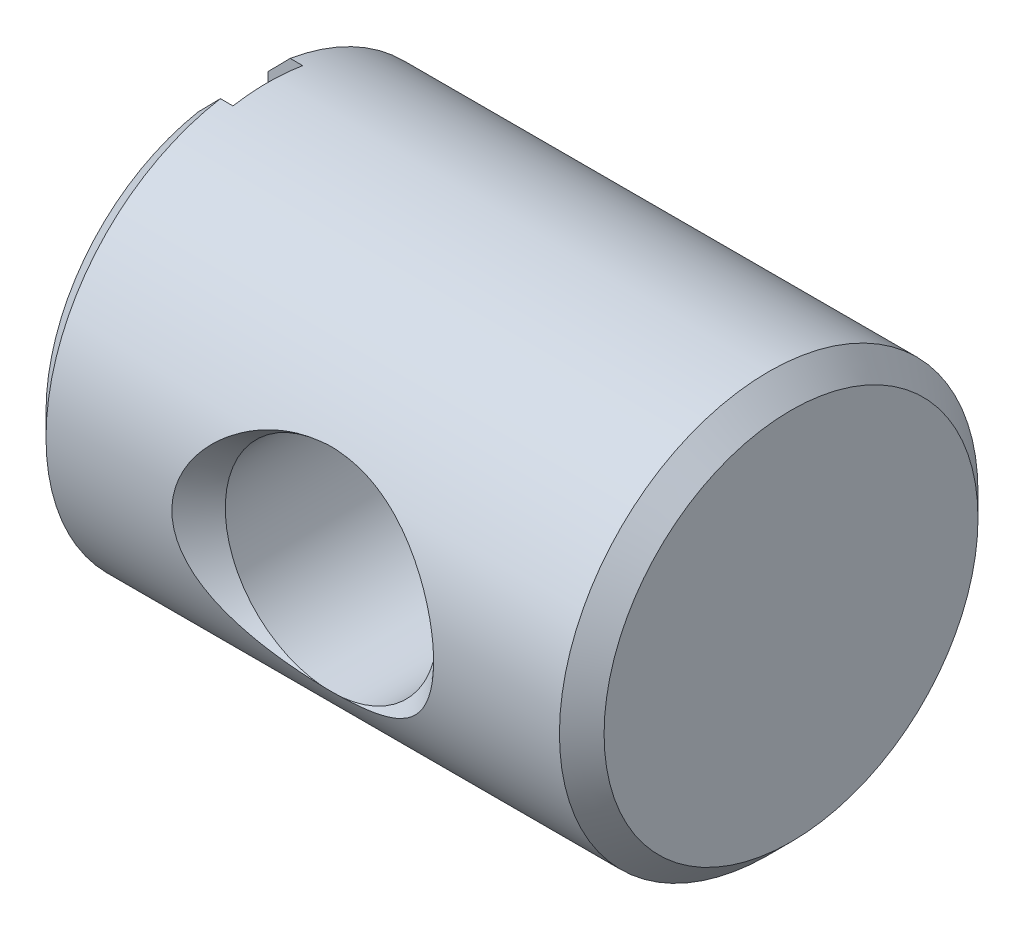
ISO-10303-21;
HEADER;
FILE_DESCRIPTION(('STEP AP214'),'2;1');
FILE_NAME('part.step','',(''),(''),'','','');
FILE_SCHEMA(('AUTOMOTIVE_DESIGN { 1 0 10303 214 1 1 1 1 }'));
ENDSEC;
DATA;
#1=APPLICATION_CONTEXT('core data for automotive mechanical design processes');
#2=APPLICATION_PROTOCOL_DEFINITION('international standard','automotive_design',2000,#1);
#3=PRODUCT_CONTEXT('',#1,'mechanical');
#4=PRODUCT('Part','Part','',(#3));
#5=PRODUCT_RELATED_PRODUCT_CATEGORY('part','',(#4));
#6=PRODUCT_DEFINITION_FORMATION('','',#4);
#7=PRODUCT_DEFINITION_CONTEXT('part definition',#1,'design');
#8=PRODUCT_DEFINITION('design','',#6,#7);
#9=PRODUCT_DEFINITION_SHAPE('','',#8);
#10=(LENGTH_UNIT() NAMED_UNIT(*) SI_UNIT(.MILLI.,.METRE.));
#11=(NAMED_UNIT(*) PLANE_ANGLE_UNIT() SI_UNIT($,.RADIAN.));
#12=(NAMED_UNIT(*) SI_UNIT($,.STERADIAN.) SOLID_ANGLE_UNIT());
#13=UNCERTAINTY_MEASURE_WITH_UNIT(LENGTH_MEASURE(1.E-05),#10,'distance_accuracy_value','');
#14=(GEOMETRIC_REPRESENTATION_CONTEXT(3) GLOBAL_UNCERTAINTY_ASSIGNED_CONTEXT((#13)) GLOBAL_UNIT_ASSIGNED_CONTEXT((#10,
#11,#12)) REPRESENTATION_CONTEXT('',''));
#15=CARTESIAN_POINT('',(0.,0.,0.));
#16=DIRECTION('',(0.,0.,1.));
#17=DIRECTION('',(1.,0.,0.));
#18=AXIS2_PLACEMENT_3D('',#15,#16,#17);
#19=CARTESIAN_POINT('',(0.,0.,-6.66133814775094E-13));
#20=DIRECTION('',(1.,0.,0.));
#21=DIRECTION('',(0.,0.,-0.999999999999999));
#22=AXIS2_PLACEMENT_3D('',#19,#20,#21);
#23=PLANE('',#22);
#24=CARTESIAN_POINT('',(0.,0.,-6.66133814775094E-13));
#25=DIRECTION('',(1.,0.,0.));
#26=DIRECTION('',(0.,0.,-0.999999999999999));
#27=AXIS2_PLACEMENT_3D('',#24,#25,#26);
#28=CIRCLE('',#27,4.2545);
#29=CARTESIAN_POINT('',(0.,4.17980037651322,-0.793750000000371));
#30=VERTEX_POINT('',#29);
#31=CARTESIAN_POINT('',(0.,-4.17980037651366,-0.793750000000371));
#32=VERTEX_POINT('',#31);
#33=EDGE_CURVE('E124',#30,#32,#28,.F.);
#34=ORIENTED_EDGE('',*,*,#33,.T.);
#35=DIRECTION('',(0.,-1.,0.));
#36=VECTOR('',#35,1.);
#37=CARTESIAN_POINT('',(0.,5.00902571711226,-0.793750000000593));
#38=LINE('',#37,#36);
#39=EDGE_CURVE('E112',#30,#32,#38,.T.);
#40=ORIENTED_EDGE('',*,*,#39,.F.);
#41=EDGE_LOOP('',(#34,#40));
#42=FACE_BOUND('',#41,.T.);
#43=ADVANCED_FACE('F34',(#42),#23,.F.);
#44=CARTESIAN_POINT('',(0.507999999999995,0.,-6.66133814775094E-13));
#45=DIRECTION('',(1.,0.,0.));
#46=DIRECTION('',(0.,0.,-0.999999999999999));
#47=AXIS2_PLACEMENT_3D('',#44,#45,#46);
#48=CONICAL_SURFACE('',#47,4.7625,0.785398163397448);
#49=CARTESIAN_POINT('',(6.23132222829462,10.4557366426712,-0.793750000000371));
#50=CARTESIAN_POINT('',(5.86203882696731,10.0853813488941,-0.793750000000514));
#51=CARTESIAN_POINT('',(5.49280300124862,9.71497856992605,-0.793750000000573));
#52=CARTESIAN_POINT('',(4.75447807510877,8.97400009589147,-0.793750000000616));
#53=CARTESIAN_POINT('',(4.38538898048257,8.60342439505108,-0.7937500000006));
#54=CARTESIAN_POINT('',(3.64711099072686,7.86172258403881,-0.793750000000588));
#55=CARTESIAN_POINT('',(3.27792229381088,7.49059627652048,-0.793750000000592));
#56=CARTESIAN_POINT('',(2.53990734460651,6.74800938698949,-0.793750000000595));
#57=CARTESIAN_POINT('',(2.1710810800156,6.37654881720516,-0.793750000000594));
#58=CARTESIAN_POINT('',(1.45003315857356,5.64923662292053,-0.793750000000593));
#59=CARTESIAN_POINT('',(1.0977872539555,5.29340905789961,-0.793750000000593));
#60=CARTESIAN_POINT('',(0.570108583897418,4.75894843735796,-0.793750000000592));
#61=CARTESIAN_POINT('',(0.394321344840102,4.58066546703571,-0.793750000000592));
#62=CARTESIAN_POINT('',(0.0430866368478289,4.22376861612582,-0.793750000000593));
#63=CARTESIAN_POINT('',(-0.132360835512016,4.04515473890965,-0.793750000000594));
#64=CARTESIAN_POINT('',(-0.482670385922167,3.68754122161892,-0.79375000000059));
#65=CARTESIAN_POINT('',(-0.657532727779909,3.50854184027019,-0.793750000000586));
#66=CARTESIAN_POINT('',(-1.00650015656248,3.1497926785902,-0.793750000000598));
#67=CARTESIAN_POINT('',(-1.18060521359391,2.9700428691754,-0.793750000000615));
#68=CARTESIAN_POINT('',(-1.52753340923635,2.60936896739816,-0.793750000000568));
#69=CARTESIAN_POINT('',(-1.70035678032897,2.42844509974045,-0.793750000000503));
#70=CARTESIAN_POINT('',(-1.95780301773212,2.15538188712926,-0.793750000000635));
#71=CARTESIAN_POINT('',(-2.04331765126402,2.0640841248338,-0.793750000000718));
#72=CARTESIAN_POINT('',(-2.21347142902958,1.88067714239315,-0.793750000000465));
#73=CARTESIAN_POINT('',(-2.29811059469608,1.78856794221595,-0.793750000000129));
#74=CARTESIAN_POINT('',(-2.40539639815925,1.67010823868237,-0.793750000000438));
#75=CARTESIAN_POINT('',(-2.42866080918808,1.64431710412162,-0.793750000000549));
#76=CARTESIAN_POINT('',(-2.47507003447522,1.59262735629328,-0.793750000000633));
#77=CARTESIAN_POINT('',(-2.4982148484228,1.56672874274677,-0.793750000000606));
#78=CARTESIAN_POINT('',(-2.56745025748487,1.48884681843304,-0.793750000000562));
#79=CARTESIAN_POINT('',(-2.61333750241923,1.43668217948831,-0.793750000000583));
#80=CARTESIAN_POINT('',(-2.70471133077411,1.3313519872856,-0.793750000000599));
#81=CARTESIAN_POINT('',(-2.75019276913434,1.27818196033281,-0.793750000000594));
#82=CARTESIAN_POINT('',(-2.84013234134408,1.17100297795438,-0.793750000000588));
#83=CARTESIAN_POINT('',(-2.88459073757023,1.11699424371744,-0.793750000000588));
#84=CARTESIAN_POINT('',(-2.97241558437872,1.00736786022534,-0.793750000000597));
#85=CARTESIAN_POINT('',(-3.01577022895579,0.951740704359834,-0.793750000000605));
#86=CARTESIAN_POINT('',(-3.10026069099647,0.838830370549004,-0.793750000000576));
#87=CARTESIAN_POINT('',(-3.14139721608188,0.781547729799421,-0.793750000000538));
#88=CARTESIAN_POINT('',(-3.21994094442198,0.664929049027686,-0.793750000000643));
#89=CARTESIAN_POINT('',(-3.25736795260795,0.605606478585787,-0.793750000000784));
#90=CARTESIAN_POINT('',(-3.32635890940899,0.483668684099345,-0.793750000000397));
#91=CARTESIAN_POINT('',(-3.35793849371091,0.421062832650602,-0.793749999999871));
#92=CARTESIAN_POINT('',(-3.39437091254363,0.33206158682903,-0.793750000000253));
#93=CARTESIAN_POINT('',(-3.40359743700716,0.307472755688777,-0.79375000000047));
#94=CARTESIAN_POINT('',(-3.42029474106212,0.257710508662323,-0.793750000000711));
#95=CARTESIAN_POINT('',(-3.42776544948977,0.232537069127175,-0.793750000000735));
#96=CARTESIAN_POINT('',(-3.44695718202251,0.156398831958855,-0.793750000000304));
#97=CARTESIAN_POINT('',(-3.45557091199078,0.104557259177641,-0.793749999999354));
#98=CARTESIAN_POINT('',(-3.46076387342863,0.0260808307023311,-0.793749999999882));
#99=CARTESIAN_POINT('',(-3.46118841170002,-0.000337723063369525,-0.793750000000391));
#100=CARTESIAN_POINT('',(-3.459412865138,-0.0530874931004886,-0.79375000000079));
#101=CARTESIAN_POINT('',(-3.45721274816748,-0.0794187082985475,-0.79375000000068));
#102=CARTESIAN_POINT('',(-3.44683249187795,-0.158045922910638,-0.793750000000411));
#103=CARTESIAN_POINT('',(-3.43486573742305,-0.209860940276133,-0.793750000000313));
#104=CARTESIAN_POINT('',(-3.40723922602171,-0.298575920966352,-0.793750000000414));
#105=CARTESIAN_POINT('',(-3.39319917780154,-0.336023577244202,-0.793750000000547));
#106=CARTESIAN_POINT('',(-3.36192361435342,-0.409582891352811,-0.793750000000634));
#107=CARTESIAN_POINT('',(-3.34468563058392,-0.445693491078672,-0.793750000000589));
#108=CARTESIAN_POINT('',(-3.30779970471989,-0.516850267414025,-0.793750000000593));
#109=CARTESIAN_POINT('',(-3.28814100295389,-0.55189075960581,-0.793750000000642));
#110=CARTESIAN_POINT('',(-3.24711633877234,-0.620927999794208,-0.793750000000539));
#111=CARTESIAN_POINT('',(-3.22575109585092,-0.654925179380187,-0.793750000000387));
#112=CARTESIAN_POINT('',(-3.17751309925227,-0.728545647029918,-0.793750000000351));
#113=CARTESIAN_POINT('',(-3.15037194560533,-0.767991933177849,-0.793750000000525));
#114=CARTESIAN_POINT('',(-3.09478419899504,-0.845957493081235,-0.793750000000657));
#115=CARTESIAN_POINT('',(-3.06633735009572,-0.884476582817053,-0.793750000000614));
#116=CARTESIAN_POINT('',(-2.97953286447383,-0.999003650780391,-0.793750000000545));
#117=CARTESIAN_POINT('',(-2.91974864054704,-1.07392668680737,-0.793750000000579));
#118=CARTESIAN_POINT('',(-2.7978368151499,-1.22212182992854,-0.793750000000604));
#119=CARTESIAN_POINT('',(-2.7357038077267,-1.29538941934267,-0.793750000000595));
#120=CARTESIAN_POINT('',(-2.61004586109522,-1.44066547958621,-0.793750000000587));
#121=CARTESIAN_POINT('',(-2.54652150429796,-1.51267445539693,-0.793750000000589));
#122=CARTESIAN_POINT('',(-2.41839516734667,-1.65597989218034,-0.793750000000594));
#123=CARTESIAN_POINT('',(-2.35379130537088,-1.72727466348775,-0.793750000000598));
#124=CARTESIAN_POINT('',(-2.22390237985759,-1.86925325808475,-0.793750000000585));
#125=CARTESIAN_POINT('',(-2.15861724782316,-1.9399370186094,-0.793750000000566));
#126=CARTESIAN_POINT('',(-2.02765571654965,-2.08073615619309,-0.793750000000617));
#127=CARTESIAN_POINT('',(-1.96198008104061,-2.15085224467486,-0.793750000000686));
#128=CARTESIAN_POINT('',(-1.83025975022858,-2.29073195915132,-0.793750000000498));
#129=CARTESIAN_POINT('',(-1.76421506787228,-2.36049559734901,-0.793750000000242));
#130=CARTESIAN_POINT('',(-1.56688955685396,-2.56808538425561,-0.793749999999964));
#131=CARTESIAN_POINT('',(-1.43519459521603,-2.70551770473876,-0.79375000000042));
#132=CARTESIAN_POINT('',(-1.17110124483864,-2.97970525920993,-0.793750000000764));
#133=CARTESIAN_POINT('',(-1.03870285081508,-3.11646048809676,-0.793750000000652));
#134=CARTESIAN_POINT('',(-0.640799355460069,-3.52605432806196,-0.793750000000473));
#135=CARTESIAN_POINT('',(-0.374594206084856,-3.79821246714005,-0.793750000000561));
#136=CARTESIAN_POINT('',(0.158928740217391,-4.34176550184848,-0.793750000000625));
#137=CARTESIAN_POINT('',(0.426247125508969,-4.61315981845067,-0.7937500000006));
#138=CARTESIAN_POINT('',(0.961448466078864,-5.15538292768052,-0.793750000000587));
#139=CARTESIAN_POINT('',(1.22933141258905,-5.42621172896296,-0.793750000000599));
#140=CARTESIAN_POINT('',(1.7648115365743,-5.96686254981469,-0.79375000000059));
#141=CARTESIAN_POINT('',(2.03240785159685,-6.23668542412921,-0.79375000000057));
#142=CARTESIAN_POINT('',(2.56784471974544,-6.77609086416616,-0.79375000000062));
#143=CARTESIAN_POINT('',(2.83568527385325,-7.0456734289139,-0.793750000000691));
#144=CARTESIAN_POINT('',(3.63937411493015,-7.85408378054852,-0.793750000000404));
#145=CARTESIAN_POINT('',(4.17547502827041,-8.39266038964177,-0.793749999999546));
#146=CARTESIAN_POINT('',(4.83830179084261,-9.05809706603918,-0.793750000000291));
#147=CARTESIAN_POINT('',(4.96485547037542,-9.18512874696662,-0.793750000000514));
#148=CARTESIAN_POINT('',(5.21798499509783,-9.43917644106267,-0.793750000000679));
#149=CARTESIAN_POINT('',(5.34456084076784,-9.5661924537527,-0.79375000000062));
#150=CARTESIAN_POINT('',(5.5978273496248,-9.82030661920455,-0.793750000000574));
#151=CARTESIAN_POINT('',(5.72451802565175,-9.9474047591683,-0.793750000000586));
#152=CARTESIAN_POINT('',(5.97791101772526,-10.2015830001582,-0.793750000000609));
#153=CARTESIAN_POINT('',(6.10461333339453,-10.3286631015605,-0.793750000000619));
#154=CARTESIAN_POINT('',(6.23132222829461,-10.4557366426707,-0.793750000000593));
#155=B_SPLINE_CURVE_WITH_KNOTS('',3,(#49,#50,#51,#52,#53,#54,#55,#56,#57,#58,#59,#60,#61,#62,
#63,#64,#65,#66,#67,#68,#69,#70,#71,#72,#73,#74,#75,#76,#77,#78,#79,#80,#81,#82,#83,#84,#85,#86,
#87,#88,#89,#90,#91,#92,#93,#94,#95,#96,#97,#98,#99,#100,#101,#102,#103,#104,#105,#106,#107,
#108,#109,#110,#111,#112,#113,#114,#115,#116,#117,#118,#119,#120,#121,#122,#123,#124,#125,#126,
#127,#128,#129,#130,#131,#132,#133,#134,#135,#136,#137,#138,#139,#140,#141,#142,#143,#144,#145,
#146,#147,#148,#149,#150,#151,#152,#153,#154),.UNSPECIFIED.,.F.,.F.,(4,2,2,2,2,2,2,2,2,2,2,2,2,
2,2,2,2,2,2,2,2,2,2,2,2,2,2,2,2,2,2,2,2,2,2,2,2,2,2,2,2,2,2,2,2,2,2,2,2,2,2,2,4),(0.,
1.56901230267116,3.13808140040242,4.70853189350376,6.27892709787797,7.78099579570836,
8.53211046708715,9.28321752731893,10.03392115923,10.7846541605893,11.5352474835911,
11.9105207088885,12.2857847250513,12.389984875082,12.4941852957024,12.7026054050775,
12.9125027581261,13.1223456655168,13.333893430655,13.5453733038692,13.7556552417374,
13.9653665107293,14.0440946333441,14.1228259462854,14.2794494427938,14.3585974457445,
14.4377464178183,14.5963825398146,14.7162089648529,14.836128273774,14.9566012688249,
15.0770237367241,15.2206310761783,15.3642666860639,15.6517364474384,15.9399138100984,
16.2279727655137,16.5166010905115,16.8052587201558,17.0934687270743,17.3816686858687,
17.9526989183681,18.5237334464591,19.6658383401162,20.8086525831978,21.951449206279,
23.0914970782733,24.2315495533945,26.5112904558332,27.0492271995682,27.5871775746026,
28.1255456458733,28.6639000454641),.UNSPECIFIED.);
#156=CARTESIAN_POINT('',(0.507999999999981,4.69588832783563,-0.793750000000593));
#157=VERTEX_POINT('',#156);
#158=EDGE_CURVE('E109',#157,#30,#155,.T.);
#159=ORIENTED_EDGE('',*,*,#158,.F.);
#160=CARTESIAN_POINT('',(0.507999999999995,0.,-6.66133814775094E-13));
#161=DIRECTION('',(1.,0.,0.));
#162=DIRECTION('',(0.,0.,-0.999999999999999));
#163=AXIS2_PLACEMENT_3D('',#160,#161,#162);
#164=CIRCLE('',#163,4.7625);
#165=CARTESIAN_POINT('',(0.507999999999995,-4.69588832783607,-0.793750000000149));
#166=VERTEX_POINT('',#165);
#167=EDGE_CURVE('E133',#166,#157,#164,.T.);
#168=ORIENTED_EDGE('',*,*,#167,.F.);
#169=EDGE_CURVE('E121',#32,#166,#155,.T.);
#170=ORIENTED_EDGE('',*,*,#169,.F.);
#171=ORIENTED_EDGE('',*,*,#33,.F.);
#172=EDGE_LOOP('',(#159,#168,#170,#171));
#173=FACE_BOUND('',#172,.T.);
#174=ADVANCED_FACE('F126',(#173),#48,.T.);
#175=CARTESIAN_POINT('',(6.34999999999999,-8.88178419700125E-13,-1.33613340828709));
#176=DIRECTION('',(0.,0.,-0.999999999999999));
#177=DIRECTION('',(0.,1.,0.));
#178=AXIS2_PLACEMENT_3D('',#175,#176,#177);
#179=CONICAL_SURFACE('',#178,0.,0.715584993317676);
#180=CARTESIAN_POINT('',(3.80807046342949,-1.25103311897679,-4.5952519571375));
#181=CARTESIAN_POINT('',(3.89345549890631,-1.36398602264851,-4.56450178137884));
#182=CARTESIAN_POINT('',(3.98856847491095,-1.46898019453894,-4.53144182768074));
#183=CARTESIAN_POINT('',(4.19393498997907,-1.66250313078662,-4.4640813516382));
#184=CARTESIAN_POINT('',(4.30421233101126,-1.75100548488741,-4.42977894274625));
#185=CARTESIAN_POINT('',(4.54531712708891,-1.9174792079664,-4.360436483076));
#186=CARTESIAN_POINT('',(4.67706379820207,-1.99417308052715,-4.32553218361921));
#187=CARTESIAN_POINT('',(4.95110601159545,-2.12847029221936,-4.26105250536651));
#188=CARTESIAN_POINT('',(5.09340213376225,-2.18607258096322,-4.23147741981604));
#189=CARTESIAN_POINT('',(5.4096421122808,-2.28976936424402,-4.17640903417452));
#190=CARTESIAN_POINT('',(5.58496951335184,-2.33246925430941,-4.15236158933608));
#191=CARTESIAN_POINT('',(5.94139719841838,-2.39105263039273,-4.118911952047));
#192=CARTESIAN_POINT('',(6.12249648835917,-2.40694070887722,-4.10950725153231));
#193=CARTESIAN_POINT('',(6.48334869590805,-2.41151966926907,-4.10682189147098));
#194=CARTESIAN_POINT('',(6.66309695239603,-2.40048111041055,-4.11338082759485));
#195=CARTESIAN_POINT('',(7.01787716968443,-2.3520267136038,-4.14127206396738));
#196=CARTESIAN_POINT('',(7.19290686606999,-2.31459843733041,-4.16261133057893));
#197=CARTESIAN_POINT('',(7.53256423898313,-2.21427038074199,-4.21682615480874));
#198=CARTESIAN_POINT('',(7.69724112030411,-2.15150360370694,-4.2496413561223));
#199=CARTESIAN_POINT('',(8.01303010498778,-2.00090078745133,-4.32259072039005));
#200=CARTESIAN_POINT('',(8.16414290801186,-1.91306604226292,-4.36272450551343));
#201=CARTESIAN_POINT('',(8.42538633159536,-1.72838706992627,-4.43873820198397));
#202=CARTESIAN_POINT('',(8.53821016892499,-1.63520973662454,-4.47427666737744));
#203=CARTESIAN_POINT('',(8.74716406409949,-1.43117703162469,-4.54364422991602));
#204=CARTESIAN_POINT('',(8.84332047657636,-1.32035011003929,-4.57747596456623));
#205=CARTESIAN_POINT('',(8.9954166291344,-1.10782970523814,-4.63286042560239));
#206=CARTESIAN_POINT('',(9.05555313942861,-1.0094283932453,-4.65548112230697));
#207=CARTESIAN_POINT('',(9.15979546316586,-0.803416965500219,-4.69541277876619));
#208=CARTESIAN_POINT('',(9.20391230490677,-0.695813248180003,-4.71272739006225));
#209=CARTESIAN_POINT('',(9.27351742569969,-0.472808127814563,-4.74031177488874));
#210=CARTESIAN_POINT('',(9.29885346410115,-0.357351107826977,-4.75052393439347));
#211=CARTESIAN_POINT('',(9.32812682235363,-0.12332873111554,-4.76233956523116));
#212=CARTESIAN_POINT('',(9.33207970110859,-0.00476569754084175,-4.763949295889));
#213=CARTESIAN_POINT('',(9.31916989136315,0.215721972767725,-4.75872558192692));
#214=CARTESIAN_POINT('',(9.30490301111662,0.317836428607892,-4.75294494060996));
#215=CARTESIAN_POINT('',(9.26087496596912,0.518090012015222,-4.73530315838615));
#216=CARTESIAN_POINT('',(9.23111198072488,0.616228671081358,-4.7234413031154));
#217=CARTESIAN_POINT('',(9.15714300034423,0.808165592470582,-4.69445282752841));
#218=CARTESIAN_POINT('',(9.1126760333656,0.901847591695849,-4.6772314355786));
#219=CARTESIAN_POINT('',(9.01158153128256,1.08152755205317,-4.6389828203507));
#220=CARTESIAN_POINT('',(8.95494595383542,1.16752037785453,-4.61795308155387));
#221=CARTESIAN_POINT('',(8.80246194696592,1.36960697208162,-4.56301626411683));
#222=CARTESIAN_POINT('',(8.7006909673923,1.48086434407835,-4.52770067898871));
#223=CARTESIAN_POINT('',(8.48026354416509,1.6847255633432,-4.45587687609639));
#224=CARTESIAN_POINT('',(8.3615779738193,1.77729655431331,-4.41936668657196));
#225=CARTESIAN_POINT('',(8.10918908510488,1.9450488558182,-4.34817410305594));
#226=CARTESIAN_POINT('',(7.97527873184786,2.01993341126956,-4.31352953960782));
#227=CARTESIAN_POINT('',(7.69716404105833,2.15036122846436,-4.25001339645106));
#228=CARTESIAN_POINT('',(7.55296209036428,2.20590895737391,-4.22114048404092));
#229=CARTESIAN_POINT('',(7.23331348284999,2.30474738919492,-4.16811970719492));
#230=CARTESIAN_POINT('',(7.05655640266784,2.34466067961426,-4.14546433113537));
#231=CARTESIAN_POINT('',(6.69779283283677,2.39743820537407,-4.11517263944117));
#232=CARTESIAN_POINT('',(6.5157869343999,2.41030547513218,-4.1075346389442));
#233=CARTESIAN_POINT('',(6.15474489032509,2.4087047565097,-4.1084720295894));
#234=CARTESIAN_POINT('',(5.97570613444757,2.39465426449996,-4.11679979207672));
#235=CARTESIAN_POINT('',(5.62287633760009,2.34036006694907,-4.14790009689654));
#236=CARTESIAN_POINT('',(5.4490881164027,2.30010253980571,-4.17068026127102));
#237=CARTESIAN_POINT('',(5.11157926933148,2.19407480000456,-4.22741446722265));
#238=CARTESIAN_POINT('',(4.94785204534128,2.12832151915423,-4.26136109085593));
#239=CARTESIAN_POINT('',(4.63452682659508,1.97165473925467,-4.33606990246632));
#240=CARTESIAN_POINT('',(4.48492631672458,1.88074573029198,-4.37683087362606));
#241=CARTESIAN_POINT('',(4.2294173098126,1.69198833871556,-4.4527548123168));
#242=CARTESIAN_POINT('',(4.12045053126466,1.598166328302,-4.48764287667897));
#243=CARTESIAN_POINT('',(3.91914825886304,1.39347974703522,-4.55534771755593));
#244=CARTESIAN_POINT('',(3.82678628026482,1.28264284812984,-4.5881677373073));
#245=CARTESIAN_POINT('',(3.68088713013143,1.07016519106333,-4.64170807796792));
#246=CARTESIAN_POINT('',(3.62327087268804,0.971609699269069,-4.66351585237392));
#247=CARTESIAN_POINT('',(3.5240736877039,0.765704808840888,-4.70170509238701));
#248=CARTESIAN_POINT('',(3.48248159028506,0.658361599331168,-4.71809033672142));
#249=CARTESIAN_POINT('',(3.41782794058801,0.436426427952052,-4.74378392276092));
#250=CARTESIAN_POINT('',(3.39490919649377,0.321785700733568,-4.75303769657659));
#251=CARTESIAN_POINT('',(3.37009840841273,0.0898889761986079,-4.76306176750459));
#252=CARTESIAN_POINT('',(3.36819349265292,-0.0273653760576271,-4.76383725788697));
#253=CARTESIAN_POINT('',(3.38446916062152,-0.245825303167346,-4.75725405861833));
#254=CARTESIAN_POINT('',(3.40024088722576,-0.347252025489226,-4.7508708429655));
#255=CARTESIAN_POINT('',(3.4470135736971,-0.545924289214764,-4.73215932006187));
#256=CARTESIAN_POINT('',(3.47801590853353,-0.643169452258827,-4.71983047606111));
#257=CARTESIAN_POINT('',(3.55275295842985,-0.829614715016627,-4.69061767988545));
#258=CARTESIAN_POINT('',(3.59623152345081,-0.918933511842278,-4.67382582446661));
#259=CARTESIAN_POINT('',(3.69426601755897,-1.09045842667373,-4.63681158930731));
#260=CARTESIAN_POINT('',(3.74882663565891,-1.17266151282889,-4.61658775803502));
#261=CARTESIAN_POINT('',(3.80807046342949,-1.25103311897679,-4.5952519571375));
#262=B_SPLINE_CURVE_WITH_KNOTS('',3,(#180,#181,#182,#183,#184,#185,#186,#187,#188,#189,#190,
#191,#192,#193,#194,#195,#196,#197,#198,#199,#200,#201,#202,#203,#204,#205,#206,#207,#208,#209,
#210,#211,#212,#213,#214,#215,#216,#217,#218,#219,#220,#221,#222,#223,#224,#225,#226,#227,#228,
#229,#230,#231,#232,#233,#234,#235,#236,#237,#238,#239,#240,#241,#242,#243,#244,#245,#246,#247,
#248,#249,#250,#251,#252,#253,#254,#255,#256,#257,#258,#259,#260,#261),.UNSPECIFIED.,.T.,.F.,(4,
2,2,2,2,2,2,2,2,2,2,2,2,2,2,2,2,2,2,2,2,2,2,2,2,2,2,2,2,2,2,2,2,2,2,2,2,2,2,2,4),(0.,
0.43432455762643,0.869338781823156,1.33679324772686,1.80427342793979,2.34777367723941,
2.89118082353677,3.42915033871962,3.96737358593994,4.5028076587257,5.03821409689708,
5.48829055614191,5.93764872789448,6.28885987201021,6.6398287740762,6.99361248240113,
7.34713873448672,7.65548182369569,7.96386114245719,8.27803712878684,8.59242139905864,
9.05449203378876,9.51736818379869,9.98753244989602,10.4575880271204,11.002762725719,
11.5478762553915,12.0846034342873,12.6216139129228,13.1582683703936,13.6948271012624,
14.1371025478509,14.5786661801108,14.9259971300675,15.2730855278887,15.6228040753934,
15.972308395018,16.2794086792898,16.5865366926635,16.8877621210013,17.1891152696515),.UNSPECIFIED.);
#263=CARTESIAN_POINT('',(6.12755998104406,2.40272541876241,-4.11197237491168));
#264=VERTEX_POINT('',#263);
#265=CARTESIAN_POINT('',(6.12755998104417,-2.40272541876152,-4.11197237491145));
#266=VERTEX_POINT('',#265);
#267=EDGE_CURVE('E194',#264,#266,#262,.T.);
#268=ORIENTED_EDGE('',*,*,#267,.F.);
#269=CARTESIAN_POINT('',(6.34999999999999,0.,-4.11197237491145));
#270=DIRECTION('',(0.,0.,-0.999999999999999));
#271=DIRECTION('',(0.,1.,0.));
#272=AXIS2_PLACEMENT_3D('',#269,#270,#271);
#273=CIRCLE('',#272,2.41299999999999);
#274=EDGE_CURVE('E271',#264,#266,#273,.F.);
#275=ORIENTED_EDGE('',*,*,#274,.T.);
#276=EDGE_LOOP('',(#268,#275));
#277=FACE_BOUND('',#276,.T.);
#278=ADVANCED_FACE('F326',(#277),#179,.F.);
#279=CARTESIAN_POINT('',(6.34999999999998,-4.44089209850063E-13,5.90165802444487));
#280=DIRECTION('',(0.,0.,0.999999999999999));
#281=DIRECTION('',(0.,-1.,0.));
#282=AXIS2_PLACEMENT_3D('',#279,#280,#281);
#283=CONICAL_SURFACE('',#282,3.96875000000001,0.715584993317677);
#284=CARTESIAN_POINT('',(3.80807046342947,-1.25103311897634,4.59525195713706));
#285=CARTESIAN_POINT('',(3.73738862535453,-1.15752709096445,4.62070730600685));
#286=CARTESIAN_POINT('',(3.67334190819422,-1.05852667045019,4.64459084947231));
#287=CARTESIAN_POINT('',(3.56154654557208,-0.85058990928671,4.68712383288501));
#288=CARTESIAN_POINT('',(3.51379141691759,-0.741657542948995,4.70577535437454));
#289=CARTESIAN_POINT('',(3.43739097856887,-0.51514780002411,4.73594407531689));
#290=CARTESIAN_POINT('',(3.40891512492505,-0.397503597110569,4.74739794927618));
#291=CARTESIAN_POINT('',(3.37427627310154,-0.15847474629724,4.76136186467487));
#292=CARTESIAN_POINT('',(3.36809158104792,-0.0370938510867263,4.76388060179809));
#293=CARTESIAN_POINT('',(3.37779323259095,0.187007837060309,4.75995461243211));
#294=CARTESIAN_POINT('',(3.39062909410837,0.289898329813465,4.75474859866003));
#295=CARTESIAN_POINT('',(3.43208742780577,0.491896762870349,4.73811300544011));
#296=CARTESIAN_POINT('',(3.46071150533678,0.591004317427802,4.7266827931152));
#297=CARTESIAN_POINT('',(3.53233618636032,0.78401016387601,4.69854724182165));
#298=CARTESIAN_POINT('',(3.57546005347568,0.87785545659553,4.68179674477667));
#299=CARTESIAN_POINT('',(3.67393675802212,1.0580207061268,4.64440336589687));
#300=CARTESIAN_POINT('',(3.72929734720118,1.14433584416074,4.62375801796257));
#301=CARTESIAN_POINT('',(3.87835178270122,1.34685553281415,4.56978032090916));
#302=CARTESIAN_POINT('',(3.97791876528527,1.45836635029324,4.53500337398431));
#303=CARTESIAN_POINT('',(4.19395341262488,1.66307306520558,4.46400996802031));
#304=CARTESIAN_POINT('',(4.31045020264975,1.75623673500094,4.42779110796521));
#305=CARTESIAN_POINT('',(4.55848552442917,1.92552872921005,4.35686767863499));
#306=CARTESIAN_POINT('',(4.69023460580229,2.0013611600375,4.32219654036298));
#307=CARTESIAN_POINT('',(4.96410148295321,2.13403132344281,4.25825531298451));
#308=CARTESIAN_POINT('',(5.10621722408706,2.19087280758,4.22898415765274));
#309=CARTESIAN_POINT('',(5.42262336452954,2.29327034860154,4.17447815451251));
#310=CARTESIAN_POINT('',(5.59831747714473,2.33534466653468,4.1507391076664));
#311=CARTESIAN_POINT('',(5.95537281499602,2.39261444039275,4.11799886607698));
#312=CARTESIAN_POINT('',(6.13673348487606,2.40781252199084,4.10899623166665));
#313=CARTESIAN_POINT('',(6.49768836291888,2.41096162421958,4.10714889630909));
#314=CARTESIAN_POINT('',(6.67727890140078,2.39922396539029,4.11411957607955));
#315=CARTESIAN_POINT('',(7.03161714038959,2.34941385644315,4.14276021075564));
#316=CARTESIAN_POINT('',(7.20636251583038,2.31132898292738,4.16443709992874));
#317=CARTESIAN_POINT('',(7.54552763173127,2.20968173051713,4.21924272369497));
#318=CARTESIAN_POINT('',(7.7099871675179,2.14622560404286,4.25232362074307));
#319=CARTESIAN_POINT('',(8.02521269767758,1.99422428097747,4.32568895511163));
#320=CARTESIAN_POINT('',(8.17597976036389,1.90568104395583,4.36597282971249));
#321=CARTESIAN_POINT('',(8.43590344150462,1.7200538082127,4.44197765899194));
#322=CARTESIAN_POINT('',(8.54783575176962,1.62671980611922,4.47737084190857));
#323=CARTESIAN_POINT('',(8.75502017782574,1.42252067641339,4.54636217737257));
#324=CARTESIAN_POINT('',(8.85029868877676,1.3116838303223,4.57996311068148));
#325=CARTESIAN_POINT('',(9.00095894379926,1.09916470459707,4.63492451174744));
#326=CARTESIAN_POINT('',(9.06051126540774,1.00072693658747,4.65735821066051));
#327=CARTESIAN_POINT('',(9.16358423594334,0.794738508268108,4.69688835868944));
#328=CARTESIAN_POINT('',(9.20711594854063,0.687194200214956,4.71398848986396));
#329=CARTESIAN_POINT('',(9.27557307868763,0.464434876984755,4.74113582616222));
#330=CARTESIAN_POINT('',(9.3003484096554,0.349165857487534,4.75112610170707));
#331=CARTESIAN_POINT('',(9.32858632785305,0.115634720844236,4.76252648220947));
#332=CARTESIAN_POINT('',(9.33206387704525,-0.00262523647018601,4.76394261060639));
#333=CARTESIAN_POINT('',(9.31837531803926,-0.222640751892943,4.75840418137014));
#334=CARTESIAN_POINT('',(9.3037617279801,-0.324593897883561,4.75248453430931));
#335=CARTESIAN_POINT('',(9.25910268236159,-0.524477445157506,4.73459630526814));
#336=CARTESIAN_POINT('',(9.22905536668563,-0.622407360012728,4.7226269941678));
#337=CARTESIAN_POINT('',(9.15449902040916,-0.81411026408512,4.69342562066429));
#338=CARTESIAN_POINT('',(9.10969938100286,-0.907752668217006,4.67608825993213));
#339=CARTESIAN_POINT('',(9.00795600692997,-1.08731413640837,4.63762922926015));
#340=CARTESIAN_POINT('',(8.9510041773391,-1.17322799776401,4.61650503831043));
#341=CARTESIAN_POINT('',(8.79767119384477,-1.37520237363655,4.56133366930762));
#342=CARTESIAN_POINT('',(8.69535618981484,-1.48639164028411,4.52588750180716));
#343=CARTESIAN_POINT('',(8.47384507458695,-1.69003338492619,4.45386467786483));
#344=CARTESIAN_POINT('',(8.35461983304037,-1.78245284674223,4.41728615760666));
#345=CARTESIAN_POINT('',(8.10115937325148,-1.94981363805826,4.34603591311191));
#346=CARTESIAN_POINT('',(7.96671811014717,-2.02445818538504,4.31140308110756));
#347=CARTESIAN_POINT('',(7.68756071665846,-2.15432045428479,4.24800309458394));
#348=CARTESIAN_POINT('',(7.54284701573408,-2.20954275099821,4.21923455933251));
#349=CARTESIAN_POINT('',(7.22241268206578,-2.30749228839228,4.16659271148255));
#350=CARTESIAN_POINT('',(7.04540457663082,-2.34686879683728,4.14421006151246));
#351=CARTESIAN_POINT('',(6.68624945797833,-2.39853211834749,4.1145304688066));
#352=CARTESIAN_POINT('',(6.50410321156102,-2.41082295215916,4.10723128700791));
#353=CARTESIAN_POINT('',(6.14307949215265,-2.40805531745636,4.10885278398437));
#354=CARTESIAN_POINT('',(5.96419726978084,-2.39344075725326,4.117510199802));
#355=CARTESIAN_POINT('',(5.6117441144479,-2.33805178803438,4.14920639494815));
#356=CARTESIAN_POINT('',(5.43817711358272,-2.29725848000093,4.17225556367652));
#357=CARTESIAN_POINT('',(5.10100131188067,-2.19012902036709,4.2294691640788));
#358=CARTESIAN_POINT('',(4.93739763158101,-2.12377986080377,4.26363925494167));
#359=CARTESIAN_POINT('',(4.62454710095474,-1.96593334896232,4.33867850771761));
#360=CARTESIAN_POINT('',(4.47528600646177,-1.87446130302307,4.3795409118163));
#361=CARTESIAN_POINT('',(4.23644247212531,-1.69653429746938,4.45078641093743));
#362=CARTESIAN_POINT('',(4.14208848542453,-1.61628567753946,4.48078064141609));
#363=CARTESIAN_POINT('',(3.96536697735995,-1.44308765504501,4.53952200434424));
#364=CARTESIAN_POINT('',(3.88299129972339,-1.35014697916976,4.56826997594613));
#365=CARTESIAN_POINT('',(3.80807046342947,-1.25103311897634,4.59525195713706));
#366=B_SPLINE_CURVE_WITH_KNOTS('',3,(#284,#285,#286,#287,#288,#289,#290,#291,#292,#293,#294,
#295,#296,#297,#298,#299,#300,#301,#302,#303,#304,#305,#306,#307,#308,#309,#310,#311,#312,#313,
#314,#315,#316,#317,#318,#319,#320,#321,#322,#323,#324,#325,#326,#327,#328,#329,#330,#331,#332,
#333,#334,#335,#336,#337,#338,#339,#340,#341,#342,#343,#344,#345,#346,#347,#348,#349,#350,#351,
#352,#353,#354,#355,#356,#357,#358,#359,#360,#361,#362,#363,#364,#365),.UNSPECIFIED.,.T.,.F.,(4,
2,2,2,2,2,2,2,2,2,2,2,2,2,2,2,2,2,2,2,2,2,2,2,2,2,2,2,2,2,2,2,2,2,2,2,2,2,2,2,4),(0.,
0.359496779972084,0.718850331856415,1.08132279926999,1.44344241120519,1.7534078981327,
2.06340490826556,2.37610680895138,2.68900737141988,3.14696356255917,3.60571713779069,
4.07179880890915,4.53778835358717,5.0817799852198,5.62571846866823,6.16340187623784,
6.70133898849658,7.2370464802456,7.77271213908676,8.22098774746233,8.66854629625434,
9.01884851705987,9.36890836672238,9.72174058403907,10.0743249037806,10.3823653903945,
10.6904430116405,11.0049940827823,11.3197553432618,11.7828379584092,12.2467282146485,
12.7178923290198,13.1889453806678,13.7343924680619,14.2797585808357,14.81620729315,
15.3530437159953,15.8901537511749,16.4267247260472,16.8080424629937,17.1890993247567),.UNSPECIFIED.);
#367=CARTESIAN_POINT('',(6.12755998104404,-2.40272541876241,4.11197237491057));
#368=VERTEX_POINT('',#367);
#369=CARTESIAN_POINT('',(6.12755998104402,2.4027254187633,4.11197237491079));
#370=VERTEX_POINT('',#369);
#371=EDGE_CURVE('E150',#368,#370,#366,.T.);
#372=ORIENTED_EDGE('',*,*,#371,.F.);
#373=CARTESIAN_POINT('',(6.34999999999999,0.,4.11197237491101));
#374=DIRECTION('',(0.,0.,0.999999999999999));
#375=DIRECTION('',(0.,-1.,0.));
#376=AXIS2_PLACEMENT_3D('',#373,#374,#375);
#377=CIRCLE('',#376,2.41299999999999);
#378=EDGE_CURVE('E285',#368,#370,#377,.F.);
#379=ORIENTED_EDGE('',*,*,#378,.T.);
#380=EDGE_LOOP('',(#372,#379));
#381=FACE_BOUND('',#380,.T.);
#382=ADVANCED_FACE('F163',(#381),#283,.F.);
#383=CARTESIAN_POINT('',(12.7,-4.44089209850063E-13,-6.66133814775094E-13));
#384=DIRECTION('',(-1.,0.,0.));
#385=DIRECTION('',(0.,0.,0.999999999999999));
#386=AXIS2_PLACEMENT_3D('',#383,#384,#385);
#387=CYLINDRICAL_SURFACE('',#386,4.7625);
#388=ORIENTED_EDGE('',*,*,#167,.T.);
#389=DIRECTION('',(-1.,0.,0.));
#390=VECTOR('',#389,1.);
#391=CARTESIAN_POINT('',(12.7,4.69588832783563,-0.793750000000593));
#392=LINE('',#391,#390);
#393=CARTESIAN_POINT('',(0.793749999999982,4.69588832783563,-0.793750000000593));
#394=VERTEX_POINT('',#393);
#395=EDGE_CURVE('E116',#157,#394,#392,.F.);
#396=ORIENTED_EDGE('',*,*,#395,.T.);
#397=CARTESIAN_POINT('',(0.793749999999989,0.,-6.66133814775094E-13));
#398=DIRECTION('',(-1.,0.,0.));
#399=DIRECTION('',(0.,0.,0.999999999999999));
#400=AXIS2_PLACEMENT_3D('',#397,#398,#399);
#401=CIRCLE('',#400,4.7625);
#402=CARTESIAN_POINT('',(0.79375000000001,4.69588832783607,0.79374999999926));
#403=VERTEX_POINT('',#402);
#404=EDGE_CURVE('E11',#403,#394,#401,.T.);
#405=ORIENTED_EDGE('',*,*,#404,.F.);
#406=DIRECTION('',(-1.,0.,0.));
#407=VECTOR('',#406,1.);
#408=CARTESIAN_POINT('',(12.7,4.69588832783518,0.793749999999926));
#409=LINE('',#408,#407);
#410=CARTESIAN_POINT('',(0.508000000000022,4.69588832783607,0.79374999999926));
#411=VERTEX_POINT('',#410);
#412=EDGE_CURVE('E301',#403,#411,#409,.T.);
#413=ORIENTED_EDGE('',*,*,#412,.T.);
#414=CARTESIAN_POINT('',(0.508000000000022,-4.69588832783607,0.793749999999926));
#415=VERTEX_POINT('',#414);
#416=EDGE_CURVE('E128',#411,#415,#164,.T.);
#417=ORIENTED_EDGE('',*,*,#416,.T.);
#418=DIRECTION('',(-1.,0.,0.));
#419=VECTOR('',#418,1.);
#420=CARTESIAN_POINT('',(12.7,-4.69588832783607,0.793749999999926));
#421=LINE('',#420,#419);
#422=CARTESIAN_POINT('',(0.793750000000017,-4.69588832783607,0.793749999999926));
#423=VERTEX_POINT('',#422);
#424=EDGE_CURVE('E296',#415,#423,#421,.F.);
#425=ORIENTED_EDGE('',*,*,#424,.T.);
#426=CARTESIAN_POINT('',(0.793749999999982,-4.69588832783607,-0.793750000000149));
#427=VERTEX_POINT('',#426);
#428=EDGE_CURVE('E38',#427,#423,#401,.T.);
#429=ORIENTED_EDGE('',*,*,#428,.F.);
#430=DIRECTION('',(-1.,0.,0.));
#431=VECTOR('',#430,1.);
#432=CARTESIAN_POINT('',(12.7,-4.69588832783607,-0.793749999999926));
#433=LINE('',#432,#431);
#434=EDGE_CURVE('E293',#427,#166,#433,.T.);
#435=ORIENTED_EDGE('',*,*,#434,.T.);
#436=EDGE_LOOP('',(#388,#396,#405,#413,#417,#425,#429,#435));
#437=FACE_BOUND('',#436,.T.);
#438=CARTESIAN_POINT('',(12.192,-4.44089209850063E-13,-6.66133814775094E-13));
#439=DIRECTION('',(1.,0.,0.));
#440=DIRECTION('',(0.,0.,-0.999999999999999));
#441=AXIS2_PLACEMENT_3D('',#438,#439,#440);
#442=CIRCLE('',#441,4.7625);
#443=CARTESIAN_POINT('',(12.192,-4.42238606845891E-13,-4.76250000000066));
#444=VERTEX_POINT('',#443);
#445=EDGE_CURVE('E206',#444,#444,#442,.F.);
#446=ORIENTED_EDGE('',*,*,#445,.T.);
#447=EDGE_LOOP('',(#446));
#448=FACE_BOUND('',#447,.T.);
#449=CARTESIAN_POINT('',(6.57244001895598,2.4027254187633,4.11197237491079));
#450=VERTEX_POINT('',#449);
#451=CARTESIAN_POINT('',(6.57244001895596,-2.40272541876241,4.11197237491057));
#452=VERTEX_POINT('',#451);
#453=EDGE_CURVE('E203',#450,#452,#366,.T.);
#454=ORIENTED_EDGE('',*,*,#453,.T.);
#455=CARTESIAN_POINT('',(6.57244001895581,-2.40272541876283,4.11197237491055));
#456=CARTESIAN_POINT('',(6.55392758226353,-2.40443944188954,4.11097073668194));
#457=CARTESIAN_POINT('',(6.53538874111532,-2.40594098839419,4.11009199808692));
#458=CARTESIAN_POINT('',(6.49831098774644,-2.40851368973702,4.10858497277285));
#459=CARTESIAN_POINT('',(6.47977216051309,-2.40958575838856,4.10795615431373));
#460=CARTESIAN_POINT('',(6.44269442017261,-2.41130019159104,4.10695003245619));
#461=CARTESIAN_POINT('',(6.42415554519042,-2.41194316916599,4.1065723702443));
#462=CARTESIAN_POINT('',(6.38707777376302,-2.4128001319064,4.10606892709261));
#463=CARTESIAN_POINT('',(6.36853888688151,-2.4130144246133,4.10594296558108));
#464=CARTESIAN_POINT('',(6.33146111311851,-2.4130144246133,4.10594296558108));
#465=CARTESIAN_POINT('',(6.31292222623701,-2.4128001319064,4.10606892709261));
#466=CARTESIAN_POINT('',(6.27584445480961,-2.411943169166,4.1065723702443));
#467=CARTESIAN_POINT('',(6.25730557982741,-2.41130019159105,4.10695003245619));
#468=CARTESIAN_POINT('',(6.22022783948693,-2.40958575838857,4.10795615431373));
#469=CARTESIAN_POINT('',(6.20168901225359,-2.40851368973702,4.10858497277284));
#470=CARTESIAN_POINT('',(6.1646112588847,-2.40594098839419,4.11009199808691));
#471=CARTESIAN_POINT('',(6.1460724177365,-2.40443944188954,4.11097073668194));
#472=CARTESIAN_POINT('',(6.12755998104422,-2.40272541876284,4.11197237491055));
#473=B_SPLINE_CURVE_WITH_KNOTS('',3,(#455,#456,#457,#458,#459,#460,#461,#462,#463,#464,#465,
#466,#467,#468,#469,#470,#471,#472),.UNSPECIFIED.,.F.,.F.,(4,2,2,2,2,2,2,2,4),(0.,
0.0558542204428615,0.111588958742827,0.167243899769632,0.222858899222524,0.278473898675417,
0.334128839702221,0.389863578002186,0.445717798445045),.UNSPECIFIED.);
#474=EDGE_CURVE('E289',#452,#368,#473,.T.);
#475=ORIENTED_EDGE('',*,*,#474,.T.);
#476=ORIENTED_EDGE('',*,*,#371,.T.);
#477=CARTESIAN_POINT('',(6.12755998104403,2.40272541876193,4.11197237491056));
#478=CARTESIAN_POINT('',(6.14607241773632,2.40443944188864,4.11097073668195));
#479=CARTESIAN_POINT('',(6.16461125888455,2.40594098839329,4.11009199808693));
#480=CARTESIAN_POINT('',(6.20168901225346,2.40851368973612,4.10858497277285));
#481=CARTESIAN_POINT('',(6.22022783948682,2.40958575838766,4.10795615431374));
#482=CARTESIAN_POINT('',(6.25730557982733,2.41130019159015,4.1069500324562));
#483=CARTESIAN_POINT('',(6.27584445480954,2.4119431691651,4.10657237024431));
#484=CARTESIAN_POINT('',(6.31292222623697,2.41280013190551,4.10606892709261));
#485=CARTESIAN_POINT('',(6.33146111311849,2.4130144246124,4.10594296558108));
#486=CARTESIAN_POINT('',(6.36853888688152,2.4130144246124,4.10594296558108));
#487=CARTESIAN_POINT('',(6.38707777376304,2.41280013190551,4.10606892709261));
#488=CARTESIAN_POINT('',(6.42415554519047,2.4119431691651,4.10657237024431));
#489=CARTESIAN_POINT('',(6.44269442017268,2.41130019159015,4.1069500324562));
#490=CARTESIAN_POINT('',(6.47977216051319,2.40958575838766,4.10795615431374));
#491=CARTESIAN_POINT('',(6.49831098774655,2.40851368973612,4.10858497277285));
#492=CARTESIAN_POINT('',(6.53538874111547,2.40594098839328,4.11009199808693));
#493=CARTESIAN_POINT('',(6.55392758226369,2.40443944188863,4.11097073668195));
#494=CARTESIAN_POINT('',(6.57244001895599,2.40272541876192,4.11197237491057));
#495=B_SPLINE_CURVE_WITH_KNOTS('',3,(#477,#478,#479,#480,#481,#482,#483,#484,#485,#486,#487,
#488,#489,#490,#491,#492,#493,#494),.UNSPECIFIED.,.F.,.F.,(4,2,2,2,2,2,2,2,4),(0.,
0.0558542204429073,0.111588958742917,0.167243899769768,0.222858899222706,0.278473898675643,
0.334128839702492,0.389863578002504,0.445717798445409),.UNSPECIFIED.);
#496=EDGE_CURVE('E139',#370,#450,#495,.T.);
#497=ORIENTED_EDGE('',*,*,#496,.T.);
#498=EDGE_LOOP('',(#454,#475,#476,#497));
#499=FACE_BOUND('',#498,.T.);
#500=CARTESIAN_POINT('',(6.57244001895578,-2.40272541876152,-4.11197237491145));
#501=VERTEX_POINT('',#500);
#502=CARTESIAN_POINT('',(6.57244001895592,2.40272541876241,-4.11197237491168));
#503=VERTEX_POINT('',#502);
#504=EDGE_CURVE('E202',#501,#503,#262,.T.);
#505=ORIENTED_EDGE('',*,*,#504,.T.);
#506=CARTESIAN_POINT('',(6.57244001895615,2.40272541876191,-4.11197237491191));
#507=CARTESIAN_POINT('',(6.55392758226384,2.40443944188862,-4.1109707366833));
#508=CARTESIAN_POINT('',(6.5353887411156,2.40594098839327,-4.11009199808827));
#509=CARTESIAN_POINT('',(6.49831098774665,2.40851368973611,-4.10858497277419));
#510=CARTESIAN_POINT('',(6.47977216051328,2.40958575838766,-4.10795615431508));
#511=CARTESIAN_POINT('',(6.44269442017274,2.41130019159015,-4.10695003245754));
#512=CARTESIAN_POINT('',(6.42415554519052,2.41194316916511,-4.10657237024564));
#513=CARTESIAN_POINT('',(6.38707777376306,2.41280013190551,-4.10606892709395));
#514=CARTESIAN_POINT('',(6.36853888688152,2.4130144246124,-4.10594296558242));
#515=CARTESIAN_POINT('',(6.33146111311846,2.4130144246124,-4.10594296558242));
#516=CARTESIAN_POINT('',(6.31292222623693,2.41280013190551,-4.10606892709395));
#517=CARTESIAN_POINT('',(6.27584445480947,2.41194316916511,-4.10657237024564));
#518=CARTESIAN_POINT('',(6.25730557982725,2.41130019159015,-4.10695003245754));
#519=CARTESIAN_POINT('',(6.22022783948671,2.40958575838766,-4.10795615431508));
#520=CARTESIAN_POINT('',(6.20168901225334,2.40851368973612,-4.10858497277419));
#521=CARTESIAN_POINT('',(6.16461125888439,2.40594098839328,-4.11009199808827));
#522=CARTESIAN_POINT('',(6.14607241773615,2.40443944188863,-4.1109707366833));
#523=CARTESIAN_POINT('',(6.12755998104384,2.40272541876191,-4.11197237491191));
#524=B_SPLINE_CURVE_WITH_KNOTS('',3,(#506,#507,#508,#509,#510,#511,#512,#513,#514,#515,#516,
#517,#518,#519,#520,#521,#522,#523),.UNSPECIFIED.,.F.,.F.,(4,2,2,2,2,2,2,2,4),(0.,
0.0558542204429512,0.111588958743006,0.167243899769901,0.222858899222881,0.278473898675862,
0.334128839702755,0.389863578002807,0.445717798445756),.UNSPECIFIED.);
#525=EDGE_CURVE('E209',#503,#264,#524,.T.);
#526=ORIENTED_EDGE('',*,*,#525,.T.);
#527=ORIENTED_EDGE('',*,*,#267,.T.);
#528=CARTESIAN_POINT('',(6.12755998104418,-2.40272541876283,-4.1119723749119));
#529=CARTESIAN_POINT('',(6.14607241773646,-2.40443944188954,-4.11097073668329));
#530=CARTESIAN_POINT('',(6.16461125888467,-2.40594098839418,-4.11009199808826));
#531=CARTESIAN_POINT('',(6.20168901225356,-2.40851368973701,-4.10858497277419));
#532=CARTESIAN_POINT('',(6.2202278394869,-2.40958575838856,-4.10795615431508));
#533=CARTESIAN_POINT('',(6.25730557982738,-2.41130019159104,-4.10695003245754));
#534=CARTESIAN_POINT('',(6.27584445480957,-2.41194316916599,-4.10657237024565));
#535=CARTESIAN_POINT('',(6.31292222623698,-2.41280013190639,-4.10606892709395));
#536=CARTESIAN_POINT('',(6.33146111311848,-2.41301442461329,-4.10594296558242));
#537=CARTESIAN_POINT('',(6.36853888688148,-2.41301442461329,-4.10594296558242));
#538=CARTESIAN_POINT('',(6.38707777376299,-2.41280013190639,-4.10606892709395));
#539=CARTESIAN_POINT('',(6.42415554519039,-2.41194316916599,-4.10657237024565));
#540=CARTESIAN_POINT('',(6.44269442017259,-2.41130019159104,-4.10695003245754));
#541=CARTESIAN_POINT('',(6.47977216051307,-2.40958575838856,-4.10795615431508));
#542=CARTESIAN_POINT('',(6.49831098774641,-2.40851368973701,-4.10858497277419));
#543=CARTESIAN_POINT('',(6.5353887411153,-2.40594098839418,-4.11009199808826));
#544=CARTESIAN_POINT('',(6.55392758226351,-2.40443944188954,-4.11097073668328));
#545=CARTESIAN_POINT('',(6.57244001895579,-2.40272541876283,-4.1119723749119));
#546=B_SPLINE_CURVE_WITH_KNOTS('',3,(#528,#529,#530,#531,#532,#533,#534,#535,#536,#537,#538,
#539,#540,#541,#542,#543,#544,#545),.UNSPECIFIED.,.F.,.F.,(4,2,2,2,2,2,2,2,4),(0.,
0.05585422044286,0.111588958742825,0.16724389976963,0.222858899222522,0.278473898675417,
0.334128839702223,0.38986357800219,0.445717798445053),.UNSPECIFIED.);
#547=EDGE_CURVE('E266',#266,#501,#546,.T.);
#548=ORIENTED_EDGE('',*,*,#547,.T.);
#549=EDGE_LOOP('',(#505,#526,#527,#548));
#550=FACE_BOUND('',#549,.T.);
#551=ADVANCED_FACE('F153',(#437,#448,#499,#550),#387,.T.);
#552=CARTESIAN_POINT('',(12.7,-4.44089209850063E-13,-6.66133814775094E-13));
#553=DIRECTION('',(1.,0.,0.));
#554=DIRECTION('',(0.,0.,-0.999999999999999));
#555=AXIS2_PLACEMENT_3D('',#552,#553,#554);
#556=PLANE('',#555);
#557=CARTESIAN_POINT('',(12.7,-4.44089209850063E-13,-6.66133814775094E-13));
#558=DIRECTION('',(1.,0.,0.));
#559=DIRECTION('',(0.,0.,-0.999999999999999));
#560=AXIS2_PLACEMENT_3D('',#557,#558,#559);
#561=CIRCLE('',#560,4.2545);
#562=CARTESIAN_POINT('',(12.7,-4.42436004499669E-13,-4.25450000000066));
#563=VERTEX_POINT('',#562);
#564=EDGE_CURVE('E131',#563,#563,#561,.T.);
#565=ORIENTED_EDGE('',*,*,#564,.T.);
#566=EDGE_LOOP('',(#565));
#567=FACE_BOUND('',#566,.T.);
#568=ADVANCED_FACE('F162',(#567),#556,.T.);
#569=CARTESIAN_POINT('',(0.,-4.17980037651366,0.793749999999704));
#570=VERTEX_POINT('',#569);
#571=CARTESIAN_POINT('',(0.,4.17980037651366,0.793749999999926));
#572=VERTEX_POINT('',#571);
#573=EDGE_CURVE('E127',#570,#572,#28,.F.);
#574=ORIENTED_EDGE('',*,*,#573,.T.);
#575=DIRECTION('',(0.,1.,0.));
#576=VECTOR('',#575,1.);
#577=CARTESIAN_POINT('',(0.,5.00902571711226,0.79374999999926));
#578=LINE('',#577,#576);
#579=EDGE_CURVE('E49',#570,#572,#578,.T.);
#580=ORIENTED_EDGE('',*,*,#579,.F.);
#581=EDGE_LOOP('',(#574,#580));
#582=FACE_BOUND('',#581,.T.);
#583=ADVANCED_FACE('F165',(#582),#23,.F.);
#584=ORIENTED_EDGE('',*,*,#504,.F.);
#585=EDGE_CURVE('E57',#501,#503,#273,.F.);
#586=ORIENTED_EDGE('',*,*,#585,.T.);
#587=EDGE_LOOP('',(#584,#586));
#588=FACE_BOUND('',#587,.T.);
#589=ADVANCED_FACE('F320',(#588),#179,.F.);
#590=ORIENTED_EDGE('',*,*,#453,.F.);
#591=EDGE_CURVE('E288',#450,#452,#377,.F.);
#592=ORIENTED_EDGE('',*,*,#591,.T.);
#593=EDGE_LOOP('',(#590,#592));
#594=FACE_BOUND('',#593,.T.);
#595=ADVANCED_FACE('F241',(#594),#283,.F.);
#596=CARTESIAN_POINT('',(6.23132222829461,-10.4557366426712,0.793749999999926));
#597=CARTESIAN_POINT('',(5.86203882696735,-10.0853813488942,0.793749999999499));
#598=CARTESIAN_POINT('',(5.49280300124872,-9.71497856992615,0.793749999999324));
#599=CARTESIAN_POINT('',(4.75447807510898,-8.97400009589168,0.793749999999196));
#600=CARTESIAN_POINT('',(4.38538898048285,-8.60342439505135,0.793749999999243));
#601=CARTESIAN_POINT('',(3.64711099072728,-7.86172258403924,0.793749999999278));
#602=CARTESIAN_POINT('',(3.27792229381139,-7.49059627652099,0.793749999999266));
#603=CARTESIAN_POINT('',(2.53990734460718,-6.74800938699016,0.793749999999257));
#604=CARTESIAN_POINT('',(2.17108108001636,-6.37654881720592,0.79374999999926));
#605=CARTESIAN_POINT('',(1.45003315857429,-5.64923662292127,0.793749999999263));
#606=CARTESIAN_POINT('',(1.09778725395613,-5.29340905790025,0.793749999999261));
#607=CARTESIAN_POINT('',(0.570108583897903,-4.75894843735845,0.793749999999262));
#608=CARTESIAN_POINT('',(0.394321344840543,-4.58066546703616,0.793749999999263));
#609=CARTESIAN_POINT('',(0.0430866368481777,-4.22376861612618,0.793749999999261));
#610=CARTESIAN_POINT('',(-0.132360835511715,-4.04515473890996,0.793749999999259));
#611=CARTESIAN_POINT('',(-0.482670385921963,-3.68754122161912,0.793749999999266));
#612=CARTESIAN_POINT('',(-0.657532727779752,-3.50854184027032,0.793749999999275));
#613=CARTESIAN_POINT('',(-1.00650015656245,-3.14979267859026,0.79374999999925));
#614=CARTESIAN_POINT('',(-1.18060521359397,-2.97004286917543,0.793749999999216));
#615=CARTESIAN_POINT('',(-1.52753340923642,-2.609368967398,0.79374999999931));
#616=CARTESIAN_POINT('',(-1.70035678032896,-2.42844509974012,0.793749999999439));
#617=CARTESIAN_POINT('',(-1.95780301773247,-2.15538188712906,0.793749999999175));
#618=CARTESIAN_POINT('',(-2.04331765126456,-2.06408412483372,0.793749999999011));
#619=CARTESIAN_POINT('',(-2.21347142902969,-1.88067714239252,0.793749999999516));
#620=CARTESIAN_POINT('',(-2.29811059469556,-1.78856794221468,0.793750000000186));
#621=CARTESIAN_POINT('',(-2.40539639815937,-1.67010823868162,0.793749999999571));
#622=CARTESIAN_POINT('',(-2.4286608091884,-1.64431710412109,0.793749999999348));
#623=CARTESIAN_POINT('',(-2.47507003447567,-1.59262735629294,0.793749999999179));
#624=CARTESIAN_POINT('',(-2.49821484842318,-1.5667287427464,0.793749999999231));
#625=CARTESIAN_POINT('',(-2.56745025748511,-1.48884681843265,0.793749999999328));
#626=CARTESIAN_POINT('',(-2.61333750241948,-1.436682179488,0.79374999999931));
#627=CARTESIAN_POINT('',(-2.70471133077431,-1.33135198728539,0.793749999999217));
#628=CARTESIAN_POINT('',(-2.75019276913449,-1.27818196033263,0.793749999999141));
#629=CARTESIAN_POINT('',(-2.84013234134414,-1.17100297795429,0.793749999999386));
#630=CARTESIAN_POINT('',(-2.88459073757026,-1.11699424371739,0.793749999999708));
#631=CARTESIAN_POINT('',(-2.97241558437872,-1.00736786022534,0.793749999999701));
#632=CARTESIAN_POINT('',(-3.01577022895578,-0.951740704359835,0.793749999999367));
#633=CARTESIAN_POINT('',(-3.10026069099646,-0.838830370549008,0.79374999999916));
#634=CARTESIAN_POINT('',(-3.14139721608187,-0.781547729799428,0.793749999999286));
#635=CARTESIAN_POINT('',(-3.21994094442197,-0.664929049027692,0.793749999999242));
#636=CARTESIAN_POINT('',(-3.25736795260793,-0.605606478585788,0.793749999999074));
#637=CARTESIAN_POINT('',(-3.32635890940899,-0.483668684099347,0.793749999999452));
#638=CARTESIAN_POINT('',(-3.35793849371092,-0.421062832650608,0.793749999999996));
#639=CARTESIAN_POINT('',(-3.39437091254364,-0.332061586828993,0.793749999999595));
#640=CARTESIAN_POINT('',(-3.40359743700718,-0.3074727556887,0.793749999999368));
#641=CARTESIAN_POINT('',(-3.42029474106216,-0.257710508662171,0.793749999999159));
#642=CARTESIAN_POINT('',(-3.42776544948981,-0.232537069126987,0.793749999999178));
#643=CARTESIAN_POINT('',(-3.44695718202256,-0.156398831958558,0.793749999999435));
#644=CARTESIAN_POINT('',(-3.45557091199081,-0.104557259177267,0.793749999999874));
#645=CARTESIAN_POINT('',(-3.46076387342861,-0.026080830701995,0.793749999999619));
#646=CARTESIAN_POINT('',(-3.4611884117,0.000337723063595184,0.793749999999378));
#647=CARTESIAN_POINT('',(-3.459412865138,0.0530874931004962,0.79374999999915));
#648=CARTESIAN_POINT('',(-3.45721274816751,0.0794187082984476,0.793749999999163));
#649=CARTESIAN_POINT('',(-3.44683249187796,0.158045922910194,0.793749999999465));
#650=CARTESIAN_POINT('',(-3.43486573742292,0.209860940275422,0.793750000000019));
#651=CARTESIAN_POINT('',(-3.40723922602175,0.298575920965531,0.793749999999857));
#652=CARTESIAN_POINT('',(-3.39319917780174,0.336023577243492,0.793749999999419));
#653=CARTESIAN_POINT('',(-3.36192361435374,0.409582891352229,0.793749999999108));
#654=CARTESIAN_POINT('',(-3.34468563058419,0.445693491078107,0.793749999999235));
#655=CARTESIAN_POINT('',(-3.30779970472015,0.516850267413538,0.793749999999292));
#656=CARTESIAN_POINT('',(-3.2881410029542,0.551890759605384,0.793749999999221));
#657=CARTESIAN_POINT('',(-3.24711633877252,0.620927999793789,0.793749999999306));
#658=CARTESIAN_POINT('',(-3.22575109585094,0.654925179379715,0.793749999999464));
#659=CARTESIAN_POINT('',(-3.17751309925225,0.728545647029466,0.793749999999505));
#660=CARTESIAN_POINT('',(-3.15037194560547,0.767991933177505,0.793749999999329));
#661=CARTESIAN_POINT('',(-3.09478419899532,0.845957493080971,0.793749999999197));
#662=CARTESIAN_POINT('',(-3.06633735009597,0.88447658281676,0.79374999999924));
#663=CARTESIAN_POINT('',(-2.97953286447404,0.999003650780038,0.793749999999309));
#664=CARTESIAN_POINT('',(-2.9197486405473,1.07392668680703,0.793749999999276));
#665=CARTESIAN_POINT('',(-2.79783681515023,1.22212182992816,0.79374999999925));
#666=CARTESIAN_POINT('',(-2.73570380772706,1.29538941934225,0.793749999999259));
#667=CARTESIAN_POINT('',(-2.61004586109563,1.44066547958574,0.793749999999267));
#668=CARTESIAN_POINT('',(-2.5465215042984,1.51267445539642,0.793749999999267));
#669=CARTESIAN_POINT('',(-2.41839516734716,1.65597989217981,0.793749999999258));
#670=CARTESIAN_POINT('',(-2.35379130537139,1.72727466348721,0.793749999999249));
#671=CARTESIAN_POINT('',(-2.22390237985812,1.86925325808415,0.793749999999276));
#672=CARTESIAN_POINT('',(-2.15861724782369,1.93993701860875,0.793749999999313));
#673=CARTESIAN_POINT('',(-2.02765571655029,2.08073615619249,0.793749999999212));
#674=CARTESIAN_POINT('',(-1.96198008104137,2.15085224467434,0.793749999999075));
#675=CARTESIAN_POINT('',(-1.83025975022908,2.29073195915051,0.79374999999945));
#676=CARTESIAN_POINT('',(-1.7642150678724,2.36049559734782,0.793749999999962));
#677=CARTESIAN_POINT('',(-1.56688955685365,2.56808538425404,0.793750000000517));
#678=CARTESIAN_POINT('',(-1.43519459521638,2.70551770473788,0.793749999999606));
#679=CARTESIAN_POINT('',(-1.17110124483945,2.9797052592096,0.793749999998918));
#680=CARTESIAN_POINT('',(-1.0387028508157,3.1164604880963,0.793749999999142));
#681=CARTESIAN_POINT('',(-0.640799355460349,3.52605432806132,0.793749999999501));
#682=CARTESIAN_POINT('',(-0.374594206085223,3.79821246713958,0.793749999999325));
#683=CARTESIAN_POINT('',(0.158928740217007,4.34176550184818,0.793749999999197));
#684=CARTESIAN_POINT('',(0.426247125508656,4.61315981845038,0.793749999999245));
#685=CARTESIAN_POINT('',(0.96144846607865,5.15538292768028,0.793749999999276));
#686=CARTESIAN_POINT('',(1.22933141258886,5.42621172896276,0.793749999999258));
#687=CARTESIAN_POINT('',(1.76481153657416,5.96686254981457,0.793749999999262));
#688=CARTESIAN_POINT('',(2.03240785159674,6.23668542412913,0.793749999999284));
#689=CARTESIAN_POINT('',(2.56784471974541,6.77609086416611,0.793749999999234));
#690=CARTESIAN_POINT('',(2.83568527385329,7.04567342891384,0.793749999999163));
#691=CARTESIAN_POINT('',(3.63937411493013,7.8540837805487,0.793749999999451));
#692=CARTESIAN_POINT('',(4.17547502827,8.39266038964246,0.793750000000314));
#693=CARTESIAN_POINT('',(4.83830179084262,9.05809706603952,0.793749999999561));
#694=CARTESIAN_POINT('',(4.96485547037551,9.1851287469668,0.793749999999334));
#695=CARTESIAN_POINT('',(5.21798499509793,9.43917644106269,0.79374999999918));
#696=CARTESIAN_POINT('',(5.34456084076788,9.56619245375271,0.793749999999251));
#697=CARTESIAN_POINT('',(5.59782734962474,9.82030661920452,0.793749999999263));
#698=CARTESIAN_POINT('',(5.72451802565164,9.94740475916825,0.793749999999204));
#699=CARTESIAN_POINT('',(5.97791101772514,10.201583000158,0.793749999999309));
#700=CARTESIAN_POINT('',(6.10461333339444,10.3286631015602,0.793749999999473));
#701=CARTESIAN_POINT('',(6.23132222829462,10.4557366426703,0.793749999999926));
#702=B_SPLINE_CURVE_WITH_KNOTS('',3,(#596,#597,#598,#599,#600,#601,#602,#603,#604,#605,#606,
#607,#608,#609,#610,#611,#612,#613,#614,#615,#616,#617,#618,#619,#620,#621,#622,#623,#624,#625,
#626,#627,#628,#629,#630,#631,#632,#633,#634,#635,#636,#637,#638,#639,#640,#641,#642,#643,#644,
#645,#646,#647,#648,#649,#650,#651,#652,#653,#654,#655,#656,#657,#658,#659,#660,#661,#662,#663,
#664,#665,#666,#667,#668,#669,#670,#671,#672,#673,#674,#675,#676,#677,#678,#679,#680,#681,#682,
#683,#684,#685,#686,#687,#688,#689,#690,#691,#692,#693,#694,#695,#696,#697,#698,#699,#700,#701),
.UNSPECIFIED.,.F.,.F.,(4,2,2,2,2,2,2,2,2,2,2,2,2,2,2,2,2,2,2,2,2,2,2,2,2,2,2,2,2,2,2,2,2,2,2,2,
2,2,2,2,2,2,2,2,2,2,2,2,2,2,2,2,4),(0.,1.56901230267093,3.13808140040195,4.70853189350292,
6.27892709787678,7.7809957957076,8.53211046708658,9.28321752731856,10.0339211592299,
10.7846541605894,11.5352474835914,11.9105207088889,12.2857847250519,12.3899848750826,
12.4941852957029,12.7026054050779,12.9125027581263,13.1223456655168,13.333893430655,
13.5453733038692,13.7556552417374,13.9653665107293,14.0440946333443,14.1228259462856,
14.2794494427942,14.3585974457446,14.4377464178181,14.5963825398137,14.7162089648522,
14.8361282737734,14.9566012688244,15.0770237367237,15.2206310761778,15.3642666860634,
15.6517364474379,15.9399138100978,16.227972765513,16.5166010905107,16.8052587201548,
17.0934687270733,17.3816686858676,17.9526989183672,18.5237334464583,19.6658383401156,
20.8086525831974,21.9514492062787,23.0914970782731,24.2315495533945,26.5112904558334,
27.0492271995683,27.5871775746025,28.1255456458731,28.6639000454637),.UNSPECIFIED.);
#703=EDGE_CURVE('E224',#415,#570,#702,.T.);
#704=ORIENTED_EDGE('',*,*,#703,.F.);
#705=ORIENTED_EDGE('',*,*,#416,.F.);
#706=EDGE_CURVE('E214',#572,#411,#702,.T.);
#707=ORIENTED_EDGE('',*,*,#706,.F.);
#708=ORIENTED_EDGE('',*,*,#573,.F.);
#709=EDGE_LOOP('',(#704,#705,#707,#708));
#710=FACE_BOUND('',#709,.T.);
#711=ADVANCED_FACE('F167',(#710),#48,.T.);
#712=CARTESIAN_POINT('',(12.7,-4.44089209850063E-13,-6.66133814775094E-13));
#713=DIRECTION('',(-1.,0.,0.));
#714=DIRECTION('',(0.,0.,0.999999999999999));
#715=AXIS2_PLACEMENT_3D('',#712,#713,#714);
#716=CONICAL_SURFACE('',#715,4.2545,0.785398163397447);
#717=ORIENTED_EDGE('',*,*,#445,.F.);
#718=EDGE_LOOP('',(#717));
#719=FACE_BOUND('',#718,.T.);
#720=ORIENTED_EDGE('',*,*,#564,.F.);
#721=EDGE_LOOP('',(#720));
#722=FACE_BOUND('',#721,.T.);
#723=ADVANCED_FACE('F36',(#719,#722),#716,.T.);
#724=CARTESIAN_POINT('',(6.34999999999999,-1.33226762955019E-12,7.61999999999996));
#725=DIRECTION('',(0.,0.,0.999999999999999));
#726=DIRECTION('',(1.,0.,0.));
#727=AXIS2_PLACEMENT_3D('',#724,#725,#726);
#728=CYLINDRICAL_SURFACE('',#727,2.41299999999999);
#729=ORIENTED_EDGE('',*,*,#591,.F.);
#730=ORIENTED_EDGE('',*,*,#496,.F.);
#731=ORIENTED_EDGE('',*,*,#378,.F.);
#732=ORIENTED_EDGE('',*,*,#474,.F.);
#733=EDGE_LOOP('',(#729,#730,#731,#732));
#734=FACE_BOUND('',#733,.T.);
#735=ORIENTED_EDGE('',*,*,#585,.F.);
#736=ORIENTED_EDGE('',*,*,#547,.F.);
#737=ORIENTED_EDGE('',*,*,#274,.F.);
#738=ORIENTED_EDGE('',*,*,#525,.F.);
#739=EDGE_LOOP('',(#735,#736,#737,#738));
#740=FACE_BOUND('',#739,.T.);
#741=ADVANCED_FACE('F237',(#734,#740),#728,.F.);
#742=CARTESIAN_POINT('',(0.793749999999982,-5.00902571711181,-0.793750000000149));
#743=DIRECTION('',(-1.,0.,0.));
#744=DIRECTION('',(0.,0.,0.999999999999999));
#745=AXIS2_PLACEMENT_3D('',#742,#743,#744);
#746=PLANE('',#745);
#747=ORIENTED_EDGE('',*,*,#404,.T.);
#748=DIRECTION('',(0.,-1.,0.));
#749=VECTOR('',#748,1.);
#750=CARTESIAN_POINT('',(0.793749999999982,5.00902571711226,-0.793750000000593));
#751=LINE('',#750,#749);
#752=EDGE_CURVE('E305',#394,#427,#751,.T.);
#753=ORIENTED_EDGE('',*,*,#752,.T.);
#754=ORIENTED_EDGE('',*,*,#428,.T.);
#755=DIRECTION('',(0.,1.,0.));
#756=VECTOR('',#755,1.);
#757=CARTESIAN_POINT('',(0.793750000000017,5.00902571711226,0.79374999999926));
#758=LINE('',#757,#756);
#759=EDGE_CURVE('E304',#423,#403,#758,.T.);
#760=ORIENTED_EDGE('',*,*,#759,.T.);
#761=EDGE_LOOP('',(#747,#753,#754,#760));
#762=FACE_BOUND('',#761,.T.);
#763=ADVANCED_FACE('F233',(#762),#746,.T.);
#764=CARTESIAN_POINT('',(0.793749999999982,5.00902571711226,-0.793750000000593));
#765=DIRECTION('',(0.,0.,-0.999999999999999));
#766=DIRECTION('',(0.,1.,0.));
#767=AXIS2_PLACEMENT_3D('',#764,#765,#766);
#768=PLANE('',#767);
#769=ORIENTED_EDGE('',*,*,#158,.T.);
#770=ORIENTED_EDGE('',*,*,#39,.T.);
#771=ORIENTED_EDGE('',*,*,#169,.T.);
#772=ORIENTED_EDGE('',*,*,#434,.F.);
#773=ORIENTED_EDGE('',*,*,#752,.F.);
#774=ORIENTED_EDGE('',*,*,#395,.F.);
#775=EDGE_LOOP('',(#769,#770,#771,#772,#773,#774));
#776=FACE_BOUND('',#775,.T.);
#777=ADVANCED_FACE('F111',(#776),#768,.F.);
#778=CARTESIAN_POINT('',(0.793750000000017,5.00902571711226,0.79374999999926));
#779=DIRECTION('',(0.,0.,0.999999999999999));
#780=DIRECTION('',(0.,-1.,0.));
#781=AXIS2_PLACEMENT_3D('',#778,#779,#780);
#782=PLANE('',#781);
#783=ORIENTED_EDGE('',*,*,#703,.T.);
#784=ORIENTED_EDGE('',*,*,#579,.T.);
#785=ORIENTED_EDGE('',*,*,#706,.T.);
#786=ORIENTED_EDGE('',*,*,#412,.F.);
#787=ORIENTED_EDGE('',*,*,#759,.F.);
#788=ORIENTED_EDGE('',*,*,#424,.F.);
#789=EDGE_LOOP('',(#783,#784,#785,#786,#787,#788));
#790=FACE_BOUND('',#789,.T.);
#791=ADVANCED_FACE('F229',(#790),#782,.F.);
#792=CLOSED_SHELL('',(#43,#174,#278,#382,#551,#568,#583,#589,#595,#711,#723,#741,#763,#777,#791));
#793=MANIFOLD_SOLID_BREP('B2',#792);
#794=ADVANCED_BREP_SHAPE_REPRESENTATION('',(#18,#793),#14);
#795=SHAPE_DEFINITION_REPRESENTATION(#9,#794);
ENDSEC;
END-ISO-10303-21;
